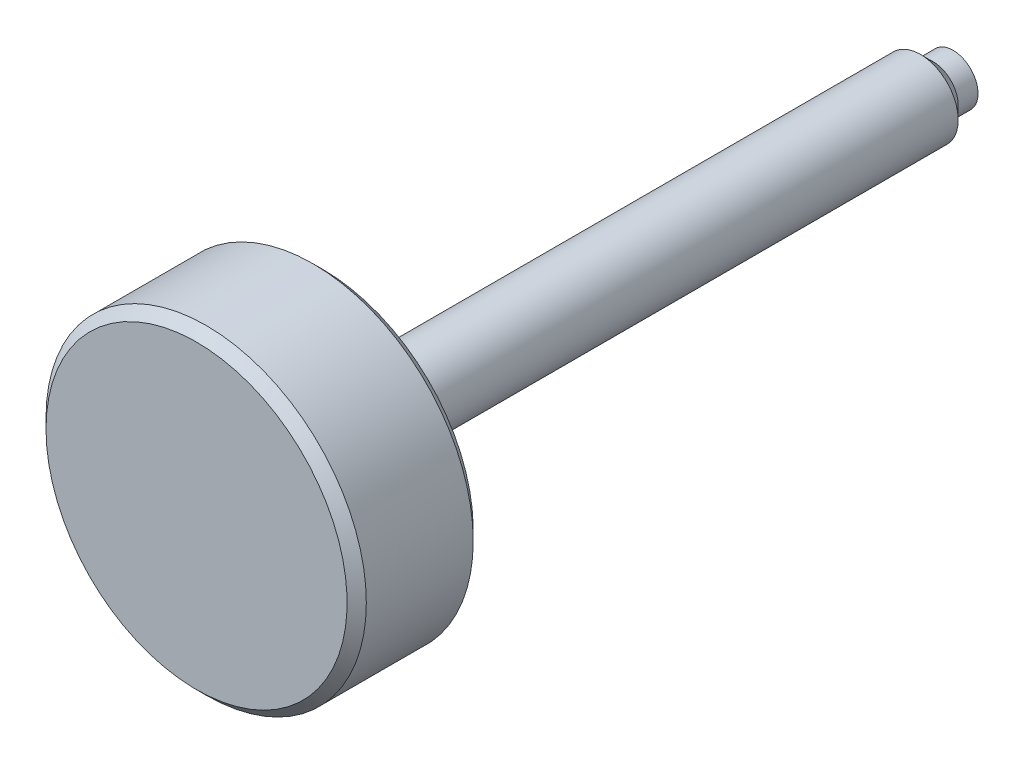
ISO-10303-21;
HEADER;
FILE_DESCRIPTION(('STEP AP214'),'2;1');
FILE_NAME('part.step','',(''),(''),'','','');
FILE_SCHEMA(('AUTOMOTIVE_DESIGN { 1 0 10303 214 1 1 1 1 }'));
ENDSEC;
DATA;
#1=APPLICATION_CONTEXT('core data for automotive mechanical design processes');
#2=APPLICATION_PROTOCOL_DEFINITION('international standard','automotive_design',2000,#1);
#3=PRODUCT_CONTEXT('',#1,'mechanical');
#4=PRODUCT('Part','Part','',(#3));
#5=PRODUCT_RELATED_PRODUCT_CATEGORY('part','',(#4));
#6=PRODUCT_DEFINITION_FORMATION('','',#4);
#7=PRODUCT_DEFINITION_CONTEXT('part definition',#1,'design');
#8=PRODUCT_DEFINITION('design','',#6,#7);
#9=PRODUCT_DEFINITION_SHAPE('','',#8);
#10=(LENGTH_UNIT() NAMED_UNIT(*) SI_UNIT(.MILLI.,.METRE.));
#11=(NAMED_UNIT(*) PLANE_ANGLE_UNIT() SI_UNIT($,.RADIAN.));
#12=(NAMED_UNIT(*) SI_UNIT($,.STERADIAN.) SOLID_ANGLE_UNIT());
#13=UNCERTAINTY_MEASURE_WITH_UNIT(LENGTH_MEASURE(1.E-05),#10,'distance_accuracy_value','');
#14=(GEOMETRIC_REPRESENTATION_CONTEXT(3) GLOBAL_UNCERTAINTY_ASSIGNED_CONTEXT((#13)) GLOBAL_UNIT_ASSIGNED_CONTEXT((#10,
#11,#12)) REPRESENTATION_CONTEXT('',''));
#15=CARTESIAN_POINT('',(0.,0.,0.));
#16=DIRECTION('',(0.,0.,1.));
#17=DIRECTION('',(1.,0.,0.));
#18=AXIS2_PLACEMENT_3D('',#15,#16,#17);
#19=CARTESIAN_POINT('',(12.081256,-12.081256,0.));
#20=DIRECTION('',(0.,0.,1.));
#21=DIRECTION('',(1.,0.,0.));
#22=AXIS2_PLACEMENT_3D('',#19,#20,#21);
#23=PLANE('',#22);
#24=CARTESIAN_POINT('',(0.,0.,0.));
#25=DIRECTION('',(0.,0.,1.));
#26=DIRECTION('',(1.,0.,0.));
#27=AXIS2_PLACEMENT_3D('',#24,#25,#26);
#28=CIRCLE('',#27,3.);
#29=CARTESIAN_POINT('',(3.,0.,0.));
#30=VERTEX_POINT('',#29);
#31=EDGE_CURVE('E43',#30,#30,#28,.T.);
#32=ORIENTED_EDGE('',*,*,#31,.T.);
#33=EDGE_LOOP('',(#32));
#34=FACE_BOUND('',#33,.T.);
#35=CARTESIAN_POINT('',(0.,0.,0.));
#36=DIRECTION('',(0.,0.,1.));
#37=DIRECTION('',(0.,1.,0.));
#38=AXIS2_PLACEMENT_3D('',#35,#36,#37);
#39=CIRCLE('',#38,11.938);
#40=CARTESIAN_POINT('',(0.,11.938,0.));
#41=VERTEX_POINT('',#40);
#42=EDGE_CURVE('E35',#41,#41,#39,.T.);
#43=ORIENTED_EDGE('',*,*,#42,.F.);
#44=EDGE_LOOP('',(#43));
#45=FACE_BOUND('',#44,.T.);
#46=ADVANCED_FACE('F12',(#34,#45),#23,.F.);
#47=CARTESIAN_POINT('',(0.,0.,0.762));
#48=DIRECTION('',(0.,0.,1.));
#49=DIRECTION('',(0.,1.,0.));
#50=AXIS2_PLACEMENT_3D('',#47,#48,#49);
#51=CONICAL_SURFACE('',#50,12.7,0.785398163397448);
#52=ORIENTED_EDGE('',*,*,#42,.T.);
#53=EDGE_LOOP('',(#52));
#54=FACE_BOUND('',#53,.T.);
#55=CARTESIAN_POINT('',(0.,0.,0.762));
#56=DIRECTION('',(0.,0.,-1.));
#57=DIRECTION('',(-1.,0.,0.));
#58=AXIS2_PLACEMENT_3D('',#55,#56,#57);
#59=CIRCLE('',#58,12.7);
#60=CARTESIAN_POINT('',(-12.7,0.,0.762));
#61=VERTEX_POINT('',#60);
#62=EDGE_CURVE('E25',#61,#61,#59,.F.);
#63=ORIENTED_EDGE('',*,*,#62,.F.);
#64=EDGE_LOOP('',(#63));
#65=FACE_BOUND('',#64,.T.);
#66=ADVANCED_FACE('F81',(#54,#65),#51,.T.);
#67=CARTESIAN_POINT('',(12.081256,12.081256,9.99998));
#68=DIRECTION('',(0.,0.,-1.));
#69=DIRECTION('',(-1.,0.,0.));
#70=AXIS2_PLACEMENT_3D('',#67,#68,#69);
#71=PLANE('',#70);
#72=CARTESIAN_POINT('',(0.,0.,9.99998));
#73=DIRECTION('',(0.,0.,-1.));
#74=DIRECTION('',(-1.,0.,0.));
#75=AXIS2_PLACEMENT_3D('',#72,#73,#74);
#76=CIRCLE('',#75,11.938);
#77=CARTESIAN_POINT('',(-11.938,0.,9.99998));
#78=VERTEX_POINT('',#77);
#79=EDGE_CURVE('E20',#78,#78,#76,.T.);
#80=ORIENTED_EDGE('',*,*,#79,.F.);
#81=EDGE_LOOP('',(#80));
#82=FACE_BOUND('',#81,.T.);
#83=ADVANCED_FACE('F76',(#82),#71,.F.);
#84=CARTESIAN_POINT('',(0.,0.,0.762));
#85=DIRECTION('',(0.,0.,-1.));
#86=DIRECTION('',(0.,-1.,0.));
#87=AXIS2_PLACEMENT_3D('',#84,#85,#86);
#88=CYLINDRICAL_SURFACE('',#87,12.7);
#89=CARTESIAN_POINT('',(0.,0.,9.23798));
#90=DIRECTION('',(0.,0.,-1.));
#91=DIRECTION('',(0.,-1.,0.));
#92=AXIS2_PLACEMENT_3D('',#89,#90,#91);
#93=CIRCLE('',#92,12.7);
#94=CARTESIAN_POINT('',(0.,-12.7,9.23797999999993));
#95=VERTEX_POINT('',#94);
#96=EDGE_CURVE('E8',#95,#95,#93,.F.);
#97=ORIENTED_EDGE('',*,*,#96,.F.);
#98=EDGE_LOOP('',(#97));
#99=FACE_BOUND('',#98,.T.);
#100=ORIENTED_EDGE('',*,*,#62,.T.);
#101=EDGE_LOOP('',(#100));
#102=FACE_BOUND('',#101,.T.);
#103=ADVANCED_FACE('F68',(#99,#102),#88,.T.);
#104=CARTESIAN_POINT('',(0.,0.,9.23798));
#105=DIRECTION('',(0.,0.,-1.));
#106=DIRECTION('',(-1.,0.,0.));
#107=AXIS2_PLACEMENT_3D('',#104,#105,#106);
#108=CONICAL_SURFACE('',#107,12.7,0.785398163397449);
#109=ORIENTED_EDGE('',*,*,#79,.T.);
#110=EDGE_LOOP('',(#109));
#111=FACE_BOUND('',#110,.T.);
#112=ORIENTED_EDGE('',*,*,#96,.T.);
#113=EDGE_LOOP('',(#112));
#114=FACE_BOUND('',#113,.T.);
#115=ADVANCED_FACE('F14',(#111,#114),#108,.T.);
#116=CARTESIAN_POINT('',(0.,0.,15.7025705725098));
#117=DIRECTION('',(0.,0.,1.));
#118=DIRECTION('',(1.,0.,0.));
#119=AXIS2_PLACEMENT_3D('',#116,#117,#118);
#120=CYLINDRICAL_SURFACE('',#119,3.);
#121=CARTESIAN_POINT('',(0.,0.,-47.3936));
#122=DIRECTION('',(0.,0.,1.));
#123=DIRECTION('',(1.,0.,0.));
#124=AXIS2_PLACEMENT_3D('',#121,#122,#123);
#125=CIRCLE('',#124,3.);
#126=CARTESIAN_POINT('',(3.,0.,-47.3936));
#127=VERTEX_POINT('',#126);
#128=EDGE_CURVE('E46',#127,#127,#125,.T.);
#129=ORIENTED_EDGE('',*,*,#128,.T.);
#130=EDGE_LOOP('',(#129));
#131=FACE_BOUND('',#130,.T.);
#132=ORIENTED_EDGE('',*,*,#31,.F.);
#133=EDGE_LOOP('',(#132));
#134=FACE_BOUND('',#133,.T.);
#135=ADVANCED_FACE('F50',(#131,#134),#120,.T.);
#136=CARTESIAN_POINT('',(2.0049744,-2.0049744,-49.9872));
#137=DIRECTION('',(0.,0.,1.));
#138=DIRECTION('',(1.,0.,0.));
#139=AXIS2_PLACEMENT_3D('',#136,#137,#138);
#140=PLANE('',#139);
#141=CARTESIAN_POINT('',(0.,0.,-49.9872));
#142=DIRECTION('',(0.,0.,-1.));
#143=DIRECTION('',(-1.,0.,0.));
#144=AXIS2_PLACEMENT_3D('',#141,#142,#143);
#145=CIRCLE('',#144,1.9812);
#146=CARTESIAN_POINT('',(-1.9812,0.,-49.9872));
#147=VERTEX_POINT('',#146);
#148=EDGE_CURVE('E16',#147,#147,#145,.F.);
#149=ORIENTED_EDGE('',*,*,#148,.F.);
#150=EDGE_LOOP('',(#149));
#151=FACE_BOUND('',#150,.T.);
#152=ADVANCED_FACE('F63',(#151),#140,.F.);
#153=CARTESIAN_POINT('',(0.,0.,-49.9872));
#154=DIRECTION('',(0.,0.,-1.));
#155=DIRECTION('',(-1.,0.,0.));
#156=AXIS2_PLACEMENT_3D('',#153,#154,#155);
#157=CYLINDRICAL_SURFACE('',#156,1.9812);
#158=CARTESIAN_POINT('',(0.,0.,-48.4124));
#159=DIRECTION('',(0.,0.,1.));
#160=DIRECTION('',(1.,0.,0.));
#161=AXIS2_PLACEMENT_3D('',#158,#159,#160);
#162=CIRCLE('',#161,1.9812);
#163=CARTESIAN_POINT('',(1.9812,0.,-48.4124));
#164=VERTEX_POINT('',#163);
#165=EDGE_CURVE('E33',#164,#164,#162,.T.);
#166=ORIENTED_EDGE('',*,*,#165,.F.);
#167=EDGE_LOOP('',(#166));
#168=FACE_BOUND('',#167,.T.);
#169=ORIENTED_EDGE('',*,*,#148,.T.);
#170=EDGE_LOOP('',(#169));
#171=FACE_BOUND('',#170,.T.);
#172=ADVANCED_FACE('F55',(#168,#171),#157,.T.);
#173=CARTESIAN_POINT('',(0.,0.,-47.39386));
#174=DIRECTION('',(0.,0.,1.));
#175=DIRECTION('',(1.,0.,0.));
#176=AXIS2_PLACEMENT_3D('',#173,#174,#175);
#177=CONICAL_SURFACE('',#176,2.99974,0.785398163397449);
#178=ORIENTED_EDGE('',*,*,#165,.T.);
#179=EDGE_LOOP('',(#178));
#180=FACE_BOUND('',#179,.T.);
#181=ORIENTED_EDGE('',*,*,#128,.F.);
#182=EDGE_LOOP('',(#181));
#183=FACE_BOUND('',#182,.T.);
#184=ADVANCED_FACE('F53',(#180,#183),#177,.T.);
#185=CLOSED_SHELL('',(#46,#66,#83,#103,#115,#135,#152,#172,#184));
#186=MANIFOLD_SOLID_BREP('B1',#185);
#187=ADVANCED_BREP_SHAPE_REPRESENTATION('',(#18,#186),#14);
#188=SHAPE_DEFINITION_REPRESENTATION(#9,#187);
ENDSEC;
END-ISO-10303-21;
